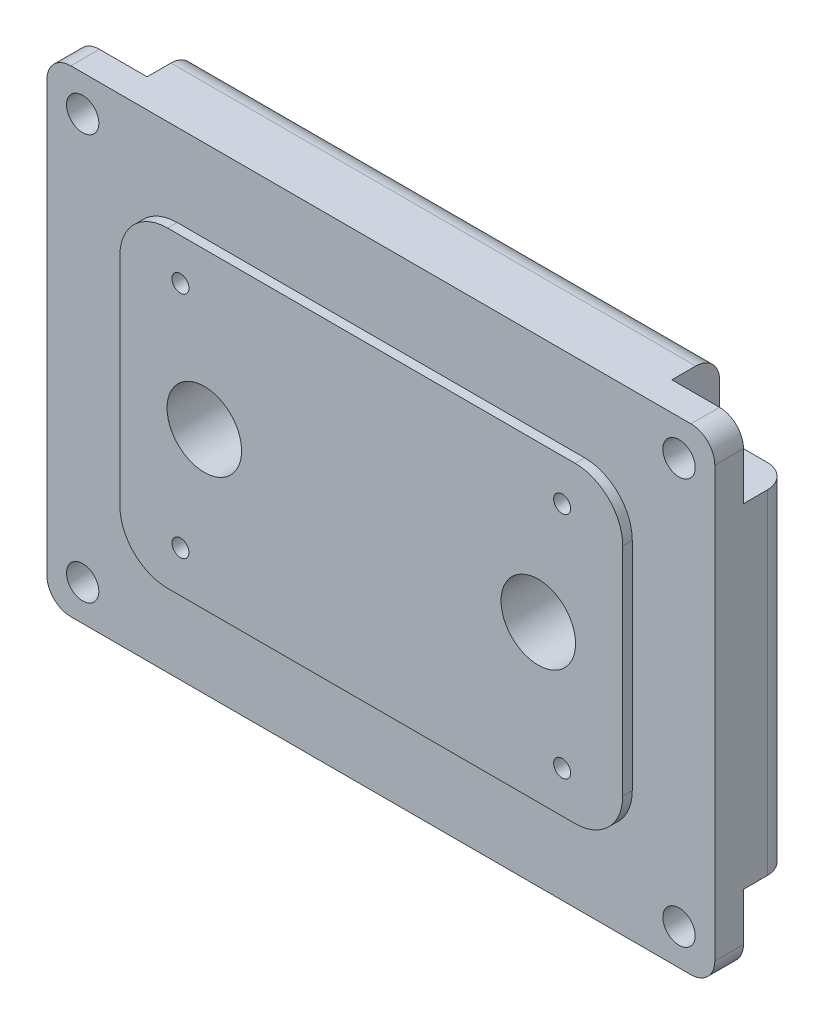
from build123d import *

# Parameters (mm, degrees)
SKETCH1_W                 = 88.9
SKETCH1_H                 = 63.5
BOSS_EXTRUDE1_DEPTH       = 10.16
SKETCH2_W                 = 66.929
SKETCH2_H                 = 41.529
BOSS_EXTRUDE2_DEPTH       = 1.27
F_7_16_20_TAPPED_HOLE1_D  = 9.92124
FILLET1_R                 = 6.35
FILLET2_R                 = 3.175
F_4_40_TAPPED_HOLE2_D     = 2.2606
F_4_40_TAPPED_HOLE2_DEPTH = 9.525
F_4_40_TAPPED_HOLE2_TIP   = 0.679152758
CUT_EXTRUDE1_DEPTH        = 6.35
F_8_CLEARANCE_HOLE1_D     = 4.3053
MIRROR2_COPY_1_DEPTH      = 6.35
MIRROR2_COPY_2_D          = 4.3053
F_8_32_TAPPED_HOLE1_D     = 3.4544
F_8_32_TAPPED_HOLE1_DEPTH = 6.35
F_8_32_TAPPED_HOLE1_TIP   = 1.037806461


with BuildPart() as part:
    # Sketch1 → Boss-Extrude1 (new body)
    with BuildSketch(Plane.XY):
        Rectangle(SKETCH1_W, SKETCH1_H)
    extrude(amount=BOSS_EXTRUDE1_DEPTH)

    # Sketch2 → Boss-Extrude2 (add)
    with BuildSketch(Plane.XY.offset(10.16)):
        Rectangle(SKETCH2_W, SKETCH2_H)
    extrude(amount=BOSS_EXTRUDE2_DEPTH)

    # 7_16-20 Tapped Hole1 (through all)
    with Locations(Plane(origin=(0, 0, 0), x_dir=(-1, 0, 0), z_dir=(0, 0, -1))):
        with Locations((-22.225, 0), (22.225, 0)):
            Hole(F_7_16_20_TAPPED_HOLE1_D / 2)

    # Fillet1
    fillet1_edges = [part.edges().sort_by_distance(p)[0] for p in [
        (-33.4645, 20.7645, 10.795),
        (-33.4645, -20.7645, 10.795),
        (33.4645, -20.7645, 10.795),
        (33.4645, 20.7645, 10.795),
    ]]
    fillet(fillet1_edges, radius=FILLET1_R)

    # Fillet2
    fillet2_edges = [part.edges().sort_by_distance(p)[0] for p in [
        (0, 31.75, 0),
        (44.45, 0, 0),
        (0, -31.75, 0),
        (-44.45, 0, 0),
        (-44.45, 31.75, 5.08),
        (44.45, 31.75, 5.08),
        (44.45, -31.75, 5.08),
        (-44.45, -31.75, 5.08),
    ]]
    fillet(fillet2_edges, radius=FILLET2_R)

    # 4-40 Tapped Hole2
    with Locations(Plane.XY.offset(11.43)):
        with Locations((-25.4, 15.24), (25.4, -15.24), (-25.4, -15.24), (25.4, 15.24)):
            Hole(F_4_40_TAPPED_HOLE2_D / 2, depth=F_4_40_TAPPED_HOLE2_DEPTH)
            with Locations((0, 0, -(F_4_40_TAPPED_HOLE2_DEPTH + F_4_40_TAPPED_HOLE2_TIP / 2))):  # 118° drill point
                Cone(0, F_4_40_TAPPED_HOLE2_D / 2, F_4_40_TAPPED_HOLE2_TIP, mode=Mode.SUBTRACT)

    # Sketch7 → Cut-Extrude1 (cut)
    with BuildSketch(Plane(origin=(0, 0, 0), x_dir=(-1, 0, 0), z_dir=(0, 0, -1))):
        with BuildLine():
            Line((-44.45, 22.225), (-38.1, 22.225))
            ThreePointArc((-38.1, 22.225), (-35.85493597, 23.15493597), (-34.925, 25.4))
            Line((-34.925, 25.4), (-34.925, 31.75))
            Line((-34.925, 31.75), (-44.45, 31.75))
            Line((-44.45, 31.75), (-44.45, 22.225))
        make_face()
    cut_extrude1 = extrude(amount=-CUT_EXTRUDE1_DEPTH, mode=Mode.SUBTRACT)

    # 8 Clearance Hole1 (through all)
    with Locations(Plane(origin=(0, 0, 6.35), x_dir=(-1, 0, 0), z_dir=(0, 0, -1))):
        with Locations((-39.6875, 26.9875)):
            f_8_clearance_hole1 = Hole(F_8_CLEARANCE_HOLE1_D / 2)

    # Mirror1: Cut-Extrude1, 8 Clearance Hole1 across plane
    add(cut_extrude1.mirror(Plane.ZX), mode=Mode.SUBTRACT)
    add(f_8_clearance_hole1.mirror(Plane.ZX), mode=Mode.SUBTRACT)

    # Mirror2: Cut-Extrude1, 8 Clearance Hole1 across plane
    add(cut_extrude1.mirror(Plane(origin=(0, 0, 0), x_dir=(0, 0, 1), z_dir=(1, 0, 0))), mode=Mode.SUBTRACT)
    add(f_8_clearance_hole1.mirror(Plane(origin=(0, 0, 0), x_dir=(0, 0, 1), z_dir=(1, 0, 0))), mode=Mode.SUBTRACT)

    # Mirror2 copy 1 sketch → Mirror2 copy 1 (cut)
    with BuildSketch(Plane(origin=(0, 0, 0), x_dir=(1, 0, 0), z_dir=(0, 0, -1))):
        with BuildLine():
            Line((-44.45, 22.225), (-38.1, 22.225))
            ThreePointArc((-38.1, 22.225), (-35.85493597, 23.15493597), (-34.925, 25.4))
            Line((-34.925, 25.4), (-34.925, 31.75))
            Line((-34.925, 31.75), (-44.45, 31.75))
            Line((-44.45, 31.75), (-44.45, 22.225))
        make_face()
    extrude(amount=-MIRROR2_COPY_1_DEPTH, mode=Mode.SUBTRACT)

    # Mirror2 copy 2 (through all)
    with Locations(Plane(origin=(0, 0, 6.35), x_dir=(1, 0, 0), z_dir=(0, 0, -1))):
        with Locations((-39.6875, 26.9875)):
            Hole(MIRROR2_COPY_2_D / 2)

    # 8-32 Tapped Hole1
    with Locations(Plane(origin=(0, 0, 0), x_dir=(-1, 0, 0), z_dir=(0, 0, -1))):
        with Locations((-8.128, 24.765), (8.128, 15.875), (-8.128, 15.875), (8.128, 24.765)):
            Hole(F_8_32_TAPPED_HOLE1_D / 2, depth=F_8_32_TAPPED_HOLE1_DEPTH)
            with Locations((0, 0, -(F_8_32_TAPPED_HOLE1_DEPTH + F_8_32_TAPPED_HOLE1_TIP / 2))):  # 118° drill point
                Cone(0, F_8_32_TAPPED_HOLE1_D / 2, F_8_32_TAPPED_HOLE1_TIP, mode=Mode.SUBTRACT)


solid = part.part
